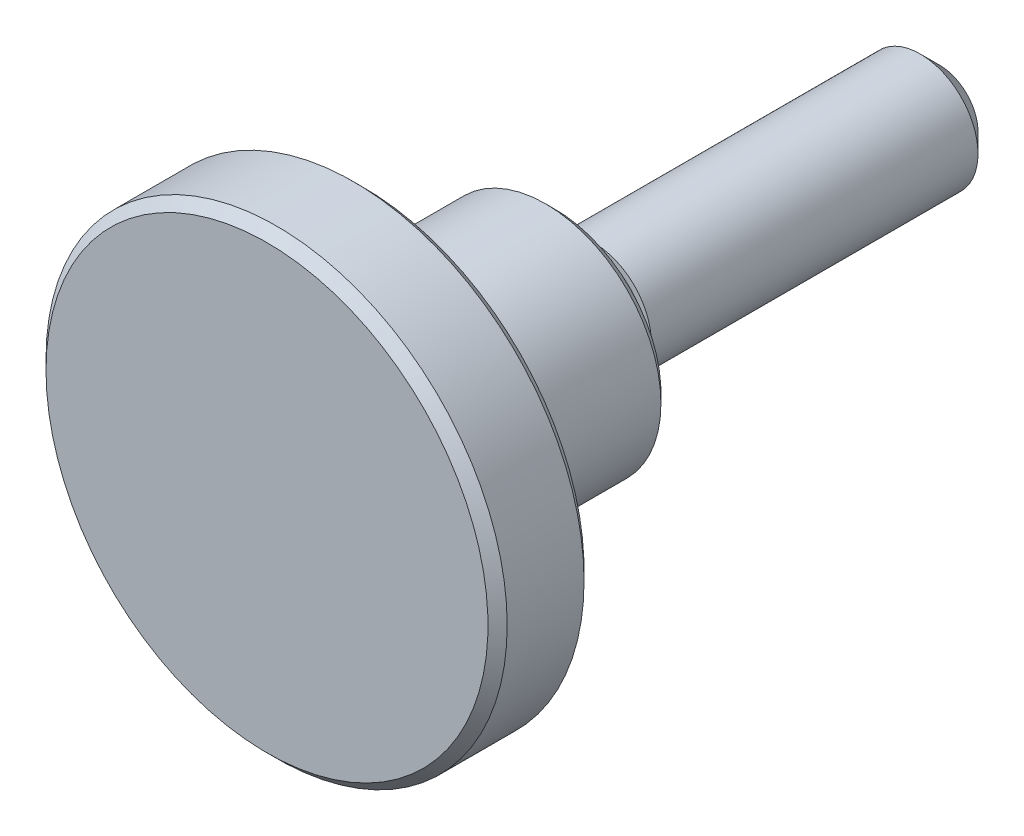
ISO-10303-21;
HEADER;
FILE_DESCRIPTION(('STEP AP214'),'2;1');
FILE_NAME('part.step','',(''),(''),'','','');
FILE_SCHEMA(('AUTOMOTIVE_DESIGN { 1 0 10303 214 1 1 1 1 }'));
ENDSEC;
DATA;
#1=APPLICATION_CONTEXT('core data for automotive mechanical design processes');
#2=APPLICATION_PROTOCOL_DEFINITION('international standard','automotive_design',2000,#1);
#3=PRODUCT_CONTEXT('',#1,'mechanical');
#4=PRODUCT('Part','Part','',(#3));
#5=PRODUCT_RELATED_PRODUCT_CATEGORY('part','',(#4));
#6=PRODUCT_DEFINITION_FORMATION('','',#4);
#7=PRODUCT_DEFINITION_CONTEXT('part definition',#1,'design');
#8=PRODUCT_DEFINITION('design','',#6,#7);
#9=PRODUCT_DEFINITION_SHAPE('','',#8);
#10=(LENGTH_UNIT() NAMED_UNIT(*) SI_UNIT(.MILLI.,.METRE.));
#11=(NAMED_UNIT(*) PLANE_ANGLE_UNIT() SI_UNIT($,.RADIAN.));
#12=(NAMED_UNIT(*) SI_UNIT($,.STERADIAN.) SOLID_ANGLE_UNIT());
#13=UNCERTAINTY_MEASURE_WITH_UNIT(LENGTH_MEASURE(1.E-05),#10,'distance_accuracy_value','');
#14=(GEOMETRIC_REPRESENTATION_CONTEXT(3) GLOBAL_UNCERTAINTY_ASSIGNED_CONTEXT((#13)) GLOBAL_UNIT_ASSIGNED_CONTEXT((#10,
#11,#12)) REPRESENTATION_CONTEXT('',''));
#15=CARTESIAN_POINT('',(0.,0.,0.));
#16=DIRECTION('',(0.,0.,1.));
#17=DIRECTION('',(1.,0.,0.));
#18=AXIS2_PLACEMENT_3D('',#15,#16,#17);
#19=CARTESIAN_POINT('',(0.,2.,-20.));
#20=DIRECTION('',(0.,0.,-1.));
#21=DIRECTION('',(-1.,0.,0.));
#22=AXIS2_PLACEMENT_3D('',#19,#20,#21);
#23=PLANE('',#22);
#24=CARTESIAN_POINT('',(0.,0.,-20.));
#25=DIRECTION('',(0.,0.,-1.));
#26=DIRECTION('',(-1.,0.,0.));
#27=AXIS2_PLACEMENT_3D('',#24,#25,#26);
#28=CIRCLE('',#27,2.);
#29=CARTESIAN_POINT('',(-2.,0.,-20.));
#30=VERTEX_POINT('',#29);
#31=EDGE_CURVE('E8',#30,#30,#28,.T.);
#32=ORIENTED_EDGE('',*,*,#31,.T.);
#33=EDGE_LOOP('',(#32));
#34=FACE_BOUND('',#33,.T.);
#35=ADVANCED_FACE('F12',(#34),#23,.T.);
#36=CARTESIAN_POINT('',(0.,0.,-20.));
#37=DIRECTION('',(0.,0.,1.));
#38=DIRECTION('',(1.,0.,0.));
#39=AXIS2_PLACEMENT_3D('',#36,#37,#38);
#40=CONICAL_SURFACE('',#39,2.,0.785398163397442);
#41=CARTESIAN_POINT('',(0.,0.,-19.));
#42=DIRECTION('',(0.,0.,-1.));
#43=DIRECTION('',(-1.,0.,0.));
#44=AXIS2_PLACEMENT_3D('',#41,#42,#43);
#45=CIRCLE('',#44,3.);
#46=CARTESIAN_POINT('',(-3.,0.,-19.));
#47=VERTEX_POINT('',#46);
#48=EDGE_CURVE('E18',#47,#47,#45,.T.);
#49=ORIENTED_EDGE('',*,*,#48,.T.);
#50=EDGE_LOOP('',(#49));
#51=FACE_BOUND('',#50,.T.);
#52=ORIENTED_EDGE('',*,*,#31,.F.);
#53=EDGE_LOOP('',(#52));
#54=FACE_BOUND('',#53,.T.);
#55=ADVANCED_FACE('F79',(#51,#54),#40,.T.);
#56=CARTESIAN_POINT('',(0.,0.,-22.5));
#57=DIRECTION('',(0.,0.,-1.));
#58=DIRECTION('',(-1.,0.,0.));
#59=AXIS2_PLACEMENT_3D('',#56,#57,#58);
#60=CYLINDRICAL_SURFACE('',#59,3.);
#61=CARTESIAN_POINT('',(0.,0.,-2.));
#62=DIRECTION('',(0.,0.,-1.));
#63=DIRECTION('',(-1.,0.,0.));
#64=AXIS2_PLACEMENT_3D('',#61,#62,#63);
#65=CIRCLE('',#64,3.);
#66=CARTESIAN_POINT('',(-3.,0.,-2.));
#67=VERTEX_POINT('',#66);
#68=EDGE_CURVE('E22',#67,#67,#65,.T.);
#69=ORIENTED_EDGE('',*,*,#68,.T.);
#70=EDGE_LOOP('',(#69));
#71=FACE_BOUND('',#70,.T.);
#72=ORIENTED_EDGE('',*,*,#48,.F.);
#73=EDGE_LOOP('',(#72));
#74=FACE_BOUND('',#73,.T.);
#75=ADVANCED_FACE('F84',(#71,#74),#60,.T.);
#76=CARTESIAN_POINT('',(0.,3.,-2.));
#77=DIRECTION('',(0.,0.,1.));
#78=DIRECTION('',(1.,0.,0.));
#79=AXIS2_PLACEMENT_3D('',#76,#77,#78);
#80=PLANE('',#79);
#81=CARTESIAN_POINT('',(0.,0.,-2.));
#82=DIRECTION('',(0.,0.,-1.));
#83=DIRECTION('',(-1.,0.,0.));
#84=AXIS2_PLACEMENT_3D('',#81,#82,#83);
#85=CIRCLE('',#84,2.7);
#86=CARTESIAN_POINT('',(-2.7,0.,-2.));
#87=VERTEX_POINT('',#86);
#88=EDGE_CURVE('E26',#87,#87,#85,.T.);
#89=ORIENTED_EDGE('',*,*,#88,.T.);
#90=EDGE_LOOP('',(#89));
#91=FACE_BOUND('',#90,.T.);
#92=ORIENTED_EDGE('',*,*,#68,.F.);
#93=EDGE_LOOP('',(#92));
#94=FACE_BOUND('',#93,.T.);
#95=ADVANCED_FACE('F89',(#91,#94),#80,.T.);
#96=CARTESIAN_POINT('',(0.,0.,-1.5));
#97=DIRECTION('',(0.,0.,-1.));
#98=DIRECTION('',(-1.,0.,0.));
#99=AXIS2_PLACEMENT_3D('',#96,#97,#98);
#100=TOROIDAL_SURFACE('',#99,2.7,0.5);
#101=CARTESIAN_POINT('',(0.,0.,-1.5));
#102=DIRECTION('',(0.,0.,-1.));
#103=DIRECTION('',(-1.,0.,0.));
#104=AXIS2_PLACEMENT_3D('',#101,#102,#103);
#105=CIRCLE('',#104,2.2);
#106=CARTESIAN_POINT('',(-2.2,0.,-1.5));
#107=VERTEX_POINT('',#106);
#108=EDGE_CURVE('E31',#107,#107,#105,.T.);
#109=ORIENTED_EDGE('',*,*,#108,.T.);
#110=EDGE_LOOP('',(#109));
#111=FACE_BOUND('',#110,.T.);
#112=ORIENTED_EDGE('',*,*,#88,.F.);
#113=EDGE_LOOP('',(#112));
#114=FACE_BOUND('',#113,.T.);
#115=ADVANCED_FACE('F96',(#111,#114),#100,.F.);
#116=CARTESIAN_POINT('',(0.,0.,-22.5));
#117=DIRECTION('',(0.,0.,-1.));
#118=DIRECTION('',(-1.,0.,0.));
#119=AXIS2_PLACEMENT_3D('',#116,#117,#118);
#120=CYLINDRICAL_SURFACE('',#119,2.2);
#121=CARTESIAN_POINT('',(0.,0.,-0.499999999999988));
#122=DIRECTION('',(0.,0.,-1.));
#123=DIRECTION('',(-1.,0.,0.));
#124=AXIS2_PLACEMENT_3D('',#121,#122,#123);
#125=CIRCLE('',#124,2.2);
#126=CARTESIAN_POINT('',(-2.2,0.,-0.499999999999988));
#127=VERTEX_POINT('',#126);
#128=EDGE_CURVE('E34',#127,#127,#125,.T.);
#129=ORIENTED_EDGE('',*,*,#128,.T.);
#130=EDGE_LOOP('',(#129));
#131=FACE_BOUND('',#130,.T.);
#132=ORIENTED_EDGE('',*,*,#108,.F.);
#133=EDGE_LOOP('',(#132));
#134=FACE_BOUND('',#133,.T.);
#135=ADVANCED_FACE('F100',(#131,#134),#120,.T.);
#136=CARTESIAN_POINT('',(0.,0.,-0.499999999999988));
#137=DIRECTION('',(0.,0.,-1.));
#138=DIRECTION('',(-1.,0.,0.));
#139=AXIS2_PLACEMENT_3D('',#136,#137,#138);
#140=TOROIDAL_SURFACE('',#139,2.7,0.5);
#141=CARTESIAN_POINT('',(0.,0.,0.));
#142=DIRECTION('',(0.,0.,-1.));
#143=DIRECTION('',(-1.,0.,0.));
#144=AXIS2_PLACEMENT_3D('',#141,#142,#143);
#145=CIRCLE('',#144,2.7);
#146=CARTESIAN_POINT('',(-2.7,0.,0.));
#147=VERTEX_POINT('',#146);
#148=EDGE_CURVE('E37',#147,#147,#145,.T.);
#149=ORIENTED_EDGE('',*,*,#148,.T.);
#150=EDGE_LOOP('',(#149));
#151=FACE_BOUND('',#150,.T.);
#152=ORIENTED_EDGE('',*,*,#128,.F.);
#153=EDGE_LOOP('',(#152));
#154=FACE_BOUND('',#153,.T.);
#155=ADVANCED_FACE('F104',(#151,#154),#140,.F.);
#156=CARTESIAN_POINT('',(0.,5.5,0.));
#157=DIRECTION('',(0.,0.,-1.));
#158=DIRECTION('',(-1.,0.,0.));
#159=AXIS2_PLACEMENT_3D('',#156,#157,#158);
#160=PLANE('',#159);
#161=CARTESIAN_POINT('',(0.,0.,0.));
#162=DIRECTION('',(0.,0.,-1.));
#163=DIRECTION('',(-1.,0.,0.));
#164=AXIS2_PLACEMENT_3D('',#161,#162,#163);
#165=CIRCLE('',#164,5.5);
#166=CARTESIAN_POINT('',(-5.5,0.,0.));
#167=VERTEX_POINT('',#166);
#168=EDGE_CURVE('E40',#167,#167,#165,.T.);
#169=ORIENTED_EDGE('',*,*,#168,.T.);
#170=EDGE_LOOP('',(#169));
#171=FACE_BOUND('',#170,.T.);
#172=ORIENTED_EDGE('',*,*,#148,.F.);
#173=EDGE_LOOP('',(#172));
#174=FACE_BOUND('',#173,.T.);
#175=ADVANCED_FACE('F108',(#171,#174),#160,.T.);
#176=CARTESIAN_POINT('',(0.,0.,0.));
#177=DIRECTION('',(0.,0.,1.));
#178=DIRECTION('',(1.,0.,0.));
#179=AXIS2_PLACEMENT_3D('',#176,#177,#178);
#180=CONICAL_SURFACE('',#179,5.5,0.785398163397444);
#181=CARTESIAN_POINT('',(0.,0.,0.500000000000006));
#182=DIRECTION('',(0.,0.,-1.));
#183=DIRECTION('',(-1.,0.,0.));
#184=AXIS2_PLACEMENT_3D('',#181,#182,#183);
#185=CIRCLE('',#184,6.);
#186=CARTESIAN_POINT('',(-6.,0.,0.500000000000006));
#187=VERTEX_POINT('',#186);
#188=EDGE_CURVE('E43',#187,#187,#185,.T.);
#189=ORIENTED_EDGE('',*,*,#188,.T.);
#190=EDGE_LOOP('',(#189));
#191=FACE_BOUND('',#190,.T.);
#192=ORIENTED_EDGE('',*,*,#168,.F.);
#193=EDGE_LOOP('',(#192));
#194=FACE_BOUND('',#193,.T.);
#195=ADVANCED_FACE('F112',(#191,#194),#180,.T.);
#196=CARTESIAN_POINT('',(0.,0.,-22.5));
#197=DIRECTION('',(0.,0.,-1.));
#198=DIRECTION('',(-1.,0.,0.));
#199=AXIS2_PLACEMENT_3D('',#196,#197,#198);
#200=CYLINDRICAL_SURFACE('',#199,6.);
#201=CARTESIAN_POINT('',(0.,0.,9.));
#202=DIRECTION('',(0.,0.,-1.));
#203=DIRECTION('',(-1.,0.,0.));
#204=AXIS2_PLACEMENT_3D('',#201,#202,#203);
#205=CIRCLE('',#204,6.);
#206=CARTESIAN_POINT('',(-6.,0.,9.));
#207=VERTEX_POINT('',#206);
#208=EDGE_CURVE('E46',#207,#207,#205,.T.);
#209=ORIENTED_EDGE('',*,*,#208,.T.);
#210=EDGE_LOOP('',(#209));
#211=FACE_BOUND('',#210,.T.);
#212=ORIENTED_EDGE('',*,*,#188,.F.);
#213=EDGE_LOOP('',(#212));
#214=FACE_BOUND('',#213,.T.);
#215=ADVANCED_FACE('F116',(#211,#214),#200,.T.);
#216=CARTESIAN_POINT('',(0.,0.,9.));
#217=DIRECTION('',(0.,0.,-1.));
#218=DIRECTION('',(-1.,0.,0.));
#219=AXIS2_PLACEMENT_3D('',#216,#217,#218);
#220=TOROIDAL_SURFACE('',#219,7.,1.);
#221=CARTESIAN_POINT('',(0.,0.,10.));
#222=DIRECTION('',(0.,0.,-1.));
#223=DIRECTION('',(-1.,0.,0.));
#224=AXIS2_PLACEMENT_3D('',#221,#222,#223);
#225=CIRCLE('',#224,7.);
#226=CARTESIAN_POINT('',(-7.,0.,10.));
#227=VERTEX_POINT('',#226);
#228=EDGE_CURVE('E49',#227,#227,#225,.T.);
#229=ORIENTED_EDGE('',*,*,#228,.T.);
#230=EDGE_LOOP('',(#229));
#231=FACE_BOUND('',#230,.T.);
#232=ORIENTED_EDGE('',*,*,#208,.F.);
#233=EDGE_LOOP('',(#232));
#234=FACE_BOUND('',#233,.T.);
#235=ADVANCED_FACE('F120',(#231,#234),#220,.F.);
#236=CARTESIAN_POINT('',(0.,11.5,10.));
#237=DIRECTION('',(0.,0.,-1.));
#238=DIRECTION('',(-1.,0.,0.));
#239=AXIS2_PLACEMENT_3D('',#236,#237,#238);
#240=PLANE('',#239);
#241=CARTESIAN_POINT('',(0.,0.,10.));
#242=DIRECTION('',(0.,0.,-1.));
#243=DIRECTION('',(-1.,0.,0.));
#244=AXIS2_PLACEMENT_3D('',#241,#242,#243);
#245=CIRCLE('',#244,11.5);
#246=CARTESIAN_POINT('',(-11.5,0.,10.));
#247=VERTEX_POINT('',#246);
#248=EDGE_CURVE('E52',#247,#247,#245,.T.);
#249=ORIENTED_EDGE('',*,*,#248,.T.);
#250=EDGE_LOOP('',(#249));
#251=FACE_BOUND('',#250,.T.);
#252=ORIENTED_EDGE('',*,*,#228,.F.);
#253=EDGE_LOOP('',(#252));
#254=FACE_BOUND('',#253,.T.);
#255=ADVANCED_FACE('F124',(#251,#254),#240,.T.);
#256=CARTESIAN_POINT('',(0.,0.,10.));
#257=DIRECTION('',(0.,0.,1.));
#258=DIRECTION('',(1.,0.,0.));
#259=AXIS2_PLACEMENT_3D('',#256,#257,#258);
#260=CONICAL_SURFACE('',#259,11.5,0.785398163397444);
#261=CARTESIAN_POINT('',(0.,0.,10.5));
#262=DIRECTION('',(0.,0.,-1.));
#263=DIRECTION('',(-1.,0.,0.));
#264=AXIS2_PLACEMENT_3D('',#261,#262,#263);
#265=CIRCLE('',#264,12.);
#266=CARTESIAN_POINT('',(-12.,0.,10.5));
#267=VERTEX_POINT('',#266);
#268=EDGE_CURVE('E55',#267,#267,#265,.T.);
#269=ORIENTED_EDGE('',*,*,#268,.T.);
#270=EDGE_LOOP('',(#269));
#271=FACE_BOUND('',#270,.T.);
#272=ORIENTED_EDGE('',*,*,#248,.F.);
#273=EDGE_LOOP('',(#272));
#274=FACE_BOUND('',#273,.T.);
#275=ADVANCED_FACE('F128',(#271,#274),#260,.T.);
#276=CARTESIAN_POINT('',(0.,0.,-22.5));
#277=DIRECTION('',(0.,0.,-1.));
#278=DIRECTION('',(-1.,0.,0.));
#279=AXIS2_PLACEMENT_3D('',#276,#277,#278);
#280=CYLINDRICAL_SURFACE('',#279,12.);
#281=CARTESIAN_POINT('',(0.,0.,14.5));
#282=DIRECTION('',(0.,0.,-1.));
#283=DIRECTION('',(-1.,0.,0.));
#284=AXIS2_PLACEMENT_3D('',#281,#282,#283);
#285=CIRCLE('',#284,12.);
#286=CARTESIAN_POINT('',(-12.,0.,14.5));
#287=VERTEX_POINT('',#286);
#288=EDGE_CURVE('E58',#287,#287,#285,.T.);
#289=ORIENTED_EDGE('',*,*,#288,.T.);
#290=EDGE_LOOP('',(#289));
#291=FACE_BOUND('',#290,.T.);
#292=ORIENTED_EDGE('',*,*,#268,.F.);
#293=EDGE_LOOP('',(#292));
#294=FACE_BOUND('',#293,.T.);
#295=ADVANCED_FACE('F76',(#291,#294),#280,.T.);
#296=CARTESIAN_POINT('',(0.,0.,14.5));
#297=DIRECTION('',(0.,0.,-1.));
#298=DIRECTION('',(-1.,0.,0.));
#299=AXIS2_PLACEMENT_3D('',#296,#297,#298);
#300=CONICAL_SURFACE('',#299,12.,0.785398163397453);
#301=CARTESIAN_POINT('',(0.,0.,15.));
#302=DIRECTION('',(0.,0.,-1.));
#303=DIRECTION('',(-1.,0.,0.));
#304=AXIS2_PLACEMENT_3D('',#301,#302,#303);
#305=CIRCLE('',#304,11.5);
#306=CARTESIAN_POINT('',(-11.5,0.,15.));
#307=VERTEX_POINT('',#306);
#308=EDGE_CURVE('E61',#307,#307,#305,.T.);
#309=ORIENTED_EDGE('',*,*,#308,.T.);
#310=EDGE_LOOP('',(#309));
#311=FACE_BOUND('',#310,.T.);
#312=ORIENTED_EDGE('',*,*,#288,.F.);
#313=EDGE_LOOP('',(#312));
#314=FACE_BOUND('',#313,.T.);
#315=ADVANCED_FACE('F65',(#311,#314),#300,.T.);
#316=CARTESIAN_POINT('',(0.,11.5,15.));
#317=DIRECTION('',(0.,0.,1.));
#318=DIRECTION('',(1.,0.,0.));
#319=AXIS2_PLACEMENT_3D('',#316,#317,#318);
#320=PLANE('',#319);
#321=ORIENTED_EDGE('',*,*,#308,.F.);
#322=EDGE_LOOP('',(#321));
#323=FACE_BOUND('',#322,.T.);
#324=ADVANCED_FACE('F68',(#323),#320,.T.);
#325=CLOSED_SHELL('',(#35,#55,#75,#95,#115,#135,#155,#175,#195,#215,#235,#255,#275,#295,#315,#324));
#326=MANIFOLD_SOLID_BREP('B1',#325);
#327=ADVANCED_BREP_SHAPE_REPRESENTATION('',(#18,#326),#14);
#328=SHAPE_DEFINITION_REPRESENTATION(#9,#327);
ENDSEC;
END-ISO-10303-21;
